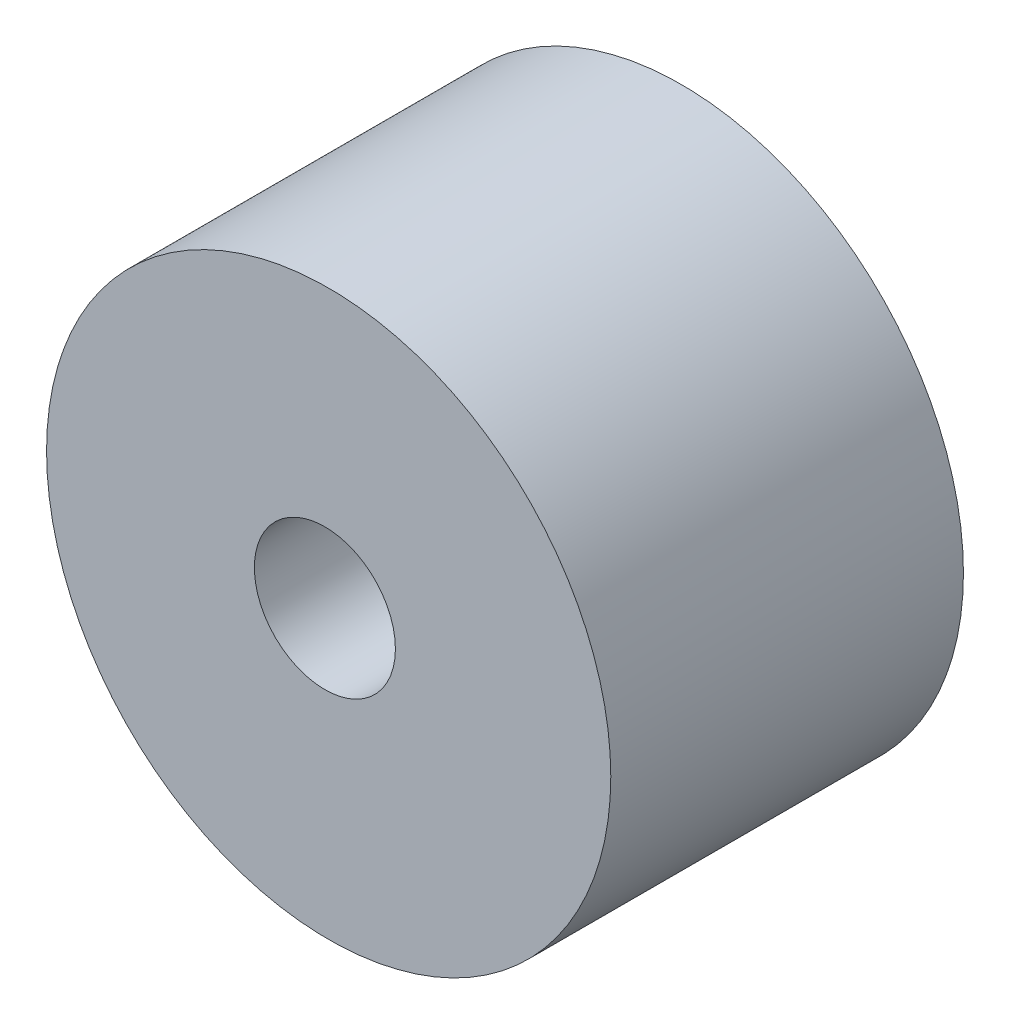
ISO-10303-21;
HEADER;
FILE_DESCRIPTION(('STEP AP214'),'2;1');
FILE_NAME('part.step','',(''),(''),'','','');
FILE_SCHEMA(('AUTOMOTIVE_DESIGN { 1 0 10303 214 1 1 1 1 }'));
ENDSEC;
DATA;
#1=APPLICATION_CONTEXT('core data for automotive mechanical design processes');
#2=APPLICATION_PROTOCOL_DEFINITION('international standard','automotive_design',2000,#1);
#3=PRODUCT_CONTEXT('',#1,'mechanical');
#4=PRODUCT('Part','Part','',(#3));
#5=PRODUCT_RELATED_PRODUCT_CATEGORY('part','',(#4));
#6=PRODUCT_DEFINITION_FORMATION('','',#4);
#7=PRODUCT_DEFINITION_CONTEXT('part definition',#1,'design');
#8=PRODUCT_DEFINITION('design','',#6,#7);
#9=PRODUCT_DEFINITION_SHAPE('','',#8);
#10=(LENGTH_UNIT() NAMED_UNIT(*) SI_UNIT(.MILLI.,.METRE.));
#11=(NAMED_UNIT(*) PLANE_ANGLE_UNIT() SI_UNIT($,.RADIAN.));
#12=(NAMED_UNIT(*) SI_UNIT($,.STERADIAN.) SOLID_ANGLE_UNIT());
#13=UNCERTAINTY_MEASURE_WITH_UNIT(LENGTH_MEASURE(1.E-05),#10,'distance_accuracy_value','');
#14=(GEOMETRIC_REPRESENTATION_CONTEXT(3) GLOBAL_UNCERTAINTY_ASSIGNED_CONTEXT((#13)) GLOBAL_UNIT_ASSIGNED_CONTEXT((#10,
#11,#12)) REPRESENTATION_CONTEXT('',''));
#15=CARTESIAN_POINT('',(0.,0.,0.));
#16=DIRECTION('',(0.,0.,1.));
#17=DIRECTION('',(1.,0.,0.));
#18=AXIS2_PLACEMENT_3D('',#15,#16,#17);
#19=CARTESIAN_POINT('',(0.358517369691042,-0.268888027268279,50.));
#20=DIRECTION('',(0.,0.,-1.));
#21=DIRECTION('',(-1.,0.,0.));
#22=AXIS2_PLACEMENT_3D('',#19,#20,#21);
#23=CYLINDRICAL_SURFACE('',#22,40.);
#24=CARTESIAN_POINT('',(0.358517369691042,-0.268888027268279,50.));
#25=DIRECTION('',(0.,0.,1.));
#26=DIRECTION('',(1.,0.,0.));
#27=AXIS2_PLACEMENT_3D('',#24,#25,#26);
#28=CIRCLE('',#27,40.);
#29=CARTESIAN_POINT('',(40.358517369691,-0.268888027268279,50.));
#30=VERTEX_POINT('',#29);
#31=EDGE_CURVE('E10',#30,#30,#28,.T.);
#32=ORIENTED_EDGE('',*,*,#31,.F.);
#33=EDGE_LOOP('',(#32));
#34=FACE_BOUND('',#33,.T.);
#35=CARTESIAN_POINT('',(0.358517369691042,-0.268888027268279,0.));
#36=DIRECTION('',(0.,0.,1.));
#37=DIRECTION('',(1.,0.,0.));
#38=AXIS2_PLACEMENT_3D('',#35,#36,#37);
#39=CIRCLE('',#38,40.);
#40=CARTESIAN_POINT('',(40.358517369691,-0.268888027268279,0.));
#41=VERTEX_POINT('',#40);
#42=EDGE_CURVE('E36',#41,#41,#39,.T.);
#43=ORIENTED_EDGE('',*,*,#42,.T.);
#44=EDGE_LOOP('',(#43));
#45=FACE_BOUND('',#44,.T.);
#46=ADVANCED_FACE('F33',(#34,#45),#23,.T.);
#47=CARTESIAN_POINT('',(0.358517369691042,-0.268888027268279,50.));
#48=DIRECTION('',(0.,0.,1.));
#49=DIRECTION('',(1.,0.,0.));
#50=AXIS2_PLACEMENT_3D('',#47,#48,#49);
#51=PLANE('',#50);
#52=CARTESIAN_POINT('',(-0.179480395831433,0.150907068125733,50.));
#53=DIRECTION('',(0.,0.,1.));
#54=DIRECTION('',(1.,0.,0.));
#55=AXIS2_PLACEMENT_3D('',#52,#53,#54);
#56=CIRCLE('',#55,10.);
#57=CARTESIAN_POINT('',(9.82051960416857,0.150907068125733,50.));
#58=VERTEX_POINT('',#57);
#59=EDGE_CURVE('E45',#58,#58,#56,.T.);
#60=ORIENTED_EDGE('',*,*,#59,.F.);
#61=EDGE_LOOP('',(#60));
#62=FACE_BOUND('',#61,.T.);
#63=ORIENTED_EDGE('',*,*,#31,.T.);
#64=EDGE_LOOP('',(#63));
#65=FACE_BOUND('',#64,.T.);
#66=ADVANCED_FACE('F60',(#62,#65),#51,.T.);
#67=CARTESIAN_POINT('',(0.358517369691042,-0.268888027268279,0.));
#68=DIRECTION('',(0.,0.,1.));
#69=DIRECTION('',(1.,0.,0.));
#70=AXIS2_PLACEMENT_3D('',#67,#68,#69);
#71=PLANE('',#70);
#72=CARTESIAN_POINT('',(-0.179480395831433,0.150907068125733,0.));
#73=DIRECTION('',(0.,0.,1.));
#74=DIRECTION('',(1.,0.,0.));
#75=AXIS2_PLACEMENT_3D('',#72,#73,#74);
#76=CIRCLE('',#75,10.);
#77=CARTESIAN_POINT('',(9.82051960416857,0.150907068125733,0.));
#78=VERTEX_POINT('',#77);
#79=EDGE_CURVE('E43',#78,#78,#76,.T.);
#80=ORIENTED_EDGE('',*,*,#79,.T.);
#81=EDGE_LOOP('',(#80));
#82=FACE_BOUND('',#81,.T.);
#83=ORIENTED_EDGE('',*,*,#42,.F.);
#84=EDGE_LOOP('',(#83));
#85=FACE_BOUND('',#84,.T.);
#86=ADVANCED_FACE('F51',(#82,#85),#71,.F.);
#87=CARTESIAN_POINT('',(-0.179480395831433,0.150907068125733,0.));
#88=DIRECTION('',(0.,0.,1.));
#89=DIRECTION('',(1.,0.,0.));
#90=AXIS2_PLACEMENT_3D('',#87,#88,#89);
#91=CYLINDRICAL_SURFACE('',#90,10.);
#92=ORIENTED_EDGE('',*,*,#79,.F.);
#93=EDGE_LOOP('',(#92));
#94=FACE_BOUND('',#93,.T.);
#95=ORIENTED_EDGE('',*,*,#59,.T.);
#96=EDGE_LOOP('',(#95));
#97=FACE_BOUND('',#96,.T.);
#98=ADVANCED_FACE('F54',(#94,#97),#91,.F.);
#99=CLOSED_SHELL('',(#46,#66,#86,#98));
#100=MANIFOLD_SOLID_BREP('B2',#99);
#101=ADVANCED_BREP_SHAPE_REPRESENTATION('',(#18,#100),#14);
#102=SHAPE_DEFINITION_REPRESENTATION(#9,#101);
ENDSEC;
END-ISO-10303-21;
